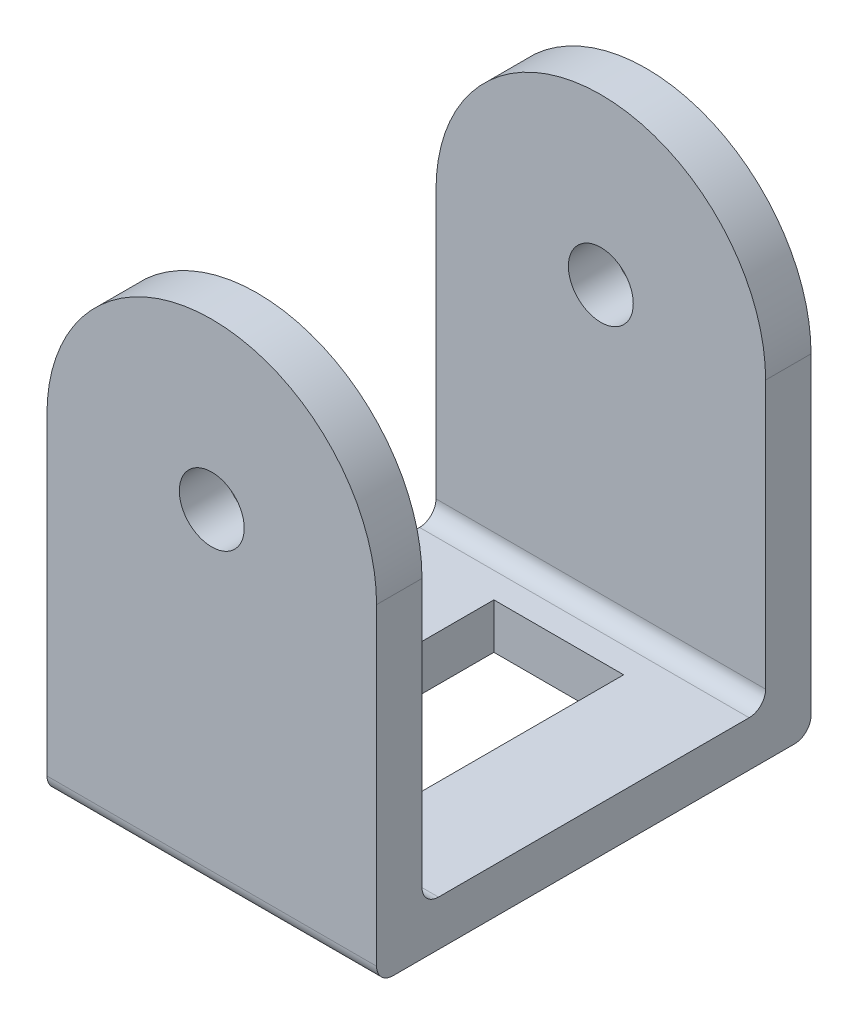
ISO-10303-21;
HEADER;
FILE_DESCRIPTION(('STEP AP214'),'2;1');
FILE_NAME('part.step','',(''),(''),'','','');
FILE_SCHEMA(('AUTOMOTIVE_DESIGN { 1 0 10303 214 1 1 1 1 }'));
ENDSEC;
DATA;
#1=APPLICATION_CONTEXT('core data for automotive mechanical design processes');
#2=APPLICATION_PROTOCOL_DEFINITION('international standard','automotive_design',2000,#1);
#3=PRODUCT_CONTEXT('',#1,'mechanical');
#4=PRODUCT('Part','Part','',(#3));
#5=PRODUCT_RELATED_PRODUCT_CATEGORY('part','',(#4));
#6=PRODUCT_DEFINITION_FORMATION('','',#4);
#7=PRODUCT_DEFINITION_CONTEXT('part definition',#1,'design');
#8=PRODUCT_DEFINITION('design','',#6,#7);
#9=PRODUCT_DEFINITION_SHAPE('','',#8);
#10=(LENGTH_UNIT() NAMED_UNIT(*) SI_UNIT(.MILLI.,.METRE.));
#11=(NAMED_UNIT(*) PLANE_ANGLE_UNIT() SI_UNIT($,.RADIAN.));
#12=(NAMED_UNIT(*) SI_UNIT($,.STERADIAN.) SOLID_ANGLE_UNIT());
#13=UNCERTAINTY_MEASURE_WITH_UNIT(LENGTH_MEASURE(1.E-05),#10,'distance_accuracy_value','');
#14=(GEOMETRIC_REPRESENTATION_CONTEXT(3) GLOBAL_UNCERTAINTY_ASSIGNED_CONTEXT((#13)) GLOBAL_UNIT_ASSIGNED_CONTEXT((#10,
#11,#12)) REPRESENTATION_CONTEXT('',''));
#15=CARTESIAN_POINT('',(0.,0.,0.));
#16=DIRECTION('',(0.,0.,1.));
#17=DIRECTION('',(1.,0.,0.));
#18=AXIS2_PLACEMENT_3D('',#15,#16,#17);
#19=CARTESIAN_POINT('',(0.,50.8,33.48));
#20=DIRECTION('',(0.,0.,1.));
#21=DIRECTION('',(1.,0.,0.));
#22=AXIS2_PLACEMENT_3D('',#19,#20,#21);
#23=CYLINDRICAL_SURFACE('',#22,25.4);
#24=DIRECTION('',(0.,0.,-1.));
#25=VECTOR('',#24,1.);
#26=CARTESIAN_POINT('',(-25.4,50.8,33.48));
#27=LINE('',#26,#25);
#28=CARTESIAN_POINT('',(-25.4,50.8,33.48));
#29=VERTEX_POINT('',#28);
#30=CARTESIAN_POINT('',(-25.4,50.8,26.48));
#31=VERTEX_POINT('',#30);
#32=EDGE_CURVE('E238',#29,#31,#27,.T.);
#33=ORIENTED_EDGE('',*,*,#32,.F.);
#34=CARTESIAN_POINT('',(0.,50.8,33.48));
#35=DIRECTION('',(0.,0.,-1.));
#36=DIRECTION('',(-1.,0.,0.));
#37=AXIS2_PLACEMENT_3D('',#34,#35,#36);
#38=CIRCLE('',#37,25.4);
#39=CARTESIAN_POINT('',(25.4,50.8,33.48));
#40=VERTEX_POINT('',#39);
#41=EDGE_CURVE('E244',#40,#29,#38,.F.);
#42=ORIENTED_EDGE('',*,*,#41,.F.);
#43=DIRECTION('',(0.,0.,-1.));
#44=VECTOR('',#43,1.);
#45=CARTESIAN_POINT('',(25.4,50.8,33.48));
#46=LINE('',#45,#44);
#47=CARTESIAN_POINT('',(25.4,50.8,26.48));
#48=VERTEX_POINT('',#47);
#49=EDGE_CURVE('E241',#48,#40,#46,.F.);
#50=ORIENTED_EDGE('',*,*,#49,.F.);
#51=CARTESIAN_POINT('',(0.,50.8,26.48));
#52=DIRECTION('',(0.,0.,1.));
#53=DIRECTION('',(1.,0.,0.));
#54=AXIS2_PLACEMENT_3D('',#51,#52,#53);
#55=CIRCLE('',#54,25.4);
#56=EDGE_CURVE('E246',#31,#48,#55,.F.);
#57=ORIENTED_EDGE('',*,*,#56,.F.);
#58=EDGE_LOOP('',(#33,#42,#50,#57));
#59=FACE_BOUND('',#58,.T.);
#60=ADVANCED_FACE('F45',(#59),#23,.T.);
#61=CARTESIAN_POINT('',(0.,50.8,-26.48));
#62=DIRECTION('',(0.,0.,1.));
#63=DIRECTION('',(1.,0.,0.));
#64=AXIS2_PLACEMENT_3D('',#61,#62,#63);
#65=CYLINDRICAL_SURFACE('',#64,25.4);
#66=DIRECTION('',(0.,0.,-1.));
#67=VECTOR('',#66,1.);
#68=CARTESIAN_POINT('',(-25.4,50.8,-26.48));
#69=LINE('',#68,#67);
#70=CARTESIAN_POINT('',(-25.4,50.8,-26.48));
#71=VERTEX_POINT('',#70);
#72=CARTESIAN_POINT('',(-25.4,50.8,-33.48));
#73=VERTEX_POINT('',#72);
#74=EDGE_CURVE('E228',#71,#73,#69,.T.);
#75=ORIENTED_EDGE('',*,*,#74,.F.);
#76=CARTESIAN_POINT('',(0.,50.8,-26.48));
#77=DIRECTION('',(0.,0.,-1.));
#78=DIRECTION('',(-1.,0.,0.));
#79=AXIS2_PLACEMENT_3D('',#76,#77,#78);
#80=CIRCLE('',#79,25.4);
#81=CARTESIAN_POINT('',(25.4,50.8,-26.48));
#82=VERTEX_POINT('',#81);
#83=EDGE_CURVE('E234',#82,#71,#80,.F.);
#84=ORIENTED_EDGE('',*,*,#83,.F.);
#85=DIRECTION('',(0.,0.,-1.));
#86=VECTOR('',#85,1.);
#87=CARTESIAN_POINT('',(25.4,50.8,-26.48));
#88=LINE('',#87,#86);
#89=CARTESIAN_POINT('',(25.4,50.8,-33.48));
#90=VERTEX_POINT('',#89);
#91=EDGE_CURVE('E231',#90,#82,#88,.F.);
#92=ORIENTED_EDGE('',*,*,#91,.F.);
#93=CARTESIAN_POINT('',(0.,50.8,-33.48));
#94=DIRECTION('',(0.,0.,1.));
#95=DIRECTION('',(1.,0.,0.));
#96=AXIS2_PLACEMENT_3D('',#93,#94,#95);
#97=CIRCLE('',#96,25.4);
#98=EDGE_CURVE('E236',#73,#90,#97,.F.);
#99=ORIENTED_EDGE('',*,*,#98,.F.);
#100=EDGE_LOOP('',(#75,#84,#92,#99));
#101=FACE_BOUND('',#100,.T.);
#102=ADVANCED_FACE('F362',(#101),#65,.T.);
#103=CARTESIAN_POINT('',(0.,7.,0.));
#104=DIRECTION('',(0.,1.,0.));
#105=DIRECTION('',(0.,0.,1.));
#106=AXIS2_PLACEMENT_3D('',#103,#104,#105);
#107=PLANE('',#106);
#108=DIRECTION('',(0.,0.,1.));
#109=VECTOR('',#108,1.);
#110=CARTESIAN_POINT('',(-10.,7.,20.));
#111=LINE('',#110,#109);
#112=CARTESIAN_POINT('',(-10.,7.,-20.));
#113=VERTEX_POINT('',#112);
#114=CARTESIAN_POINT('',(-10.,7.,20.));
#115=VERTEX_POINT('',#114);
#116=EDGE_CURVE('E165',#113,#115,#111,.T.);
#117=ORIENTED_EDGE('',*,*,#116,.F.);
#118=DIRECTION('',(-1.,0.,0.));
#119=VECTOR('',#118,1.);
#120=CARTESIAN_POINT('',(10.,7.,-20.));
#121=LINE('',#120,#119);
#122=CARTESIAN_POINT('',(10.,7.,-20.));
#123=VERTEX_POINT('',#122);
#124=EDGE_CURVE('E183',#123,#113,#121,.T.);
#125=ORIENTED_EDGE('',*,*,#124,.F.);
#126=DIRECTION('',(0.,0.,-1.));
#127=VECTOR('',#126,1.);
#128=CARTESIAN_POINT('',(10.,7.,20.));
#129=LINE('',#128,#127);
#130=CARTESIAN_POINT('',(10.,7.,20.));
#131=VERTEX_POINT('',#130);
#132=EDGE_CURVE('E186',#131,#123,#129,.T.);
#133=ORIENTED_EDGE('',*,*,#132,.F.);
#134=DIRECTION('',(1.,0.,0.));
#135=VECTOR('',#134,1.);
#136=CARTESIAN_POINT('',(10.,7.,20.));
#137=LINE('',#136,#135);
#138=EDGE_CURVE('E195',#115,#131,#137,.T.);
#139=ORIENTED_EDGE('',*,*,#138,.F.);
#140=EDGE_LOOP('',(#117,#125,#133,#139));
#141=FACE_BOUND('',#140,.T.);
#142=DIRECTION('',(0.,0.,1.));
#143=VECTOR('',#142,1.);
#144=CARTESIAN_POINT('',(-25.4,7.,33.48));
#145=LINE('',#144,#143);
#146=CARTESIAN_POINT('',(-25.4,7.,-23.94));
#147=VERTEX_POINT('',#146);
#148=CARTESIAN_POINT('',(-25.4,7.,23.94));
#149=VERTEX_POINT('',#148);
#150=EDGE_CURVE('E205',#147,#149,#145,.T.);
#151=ORIENTED_EDGE('',*,*,#150,.T.);
#152=DIRECTION('',(-1.,0.,0.));
#153=VECTOR('',#152,1.);
#154=CARTESIAN_POINT('',(0.,7.,23.94));
#155=LINE('',#154,#153);
#156=CARTESIAN_POINT('',(25.4,7.,23.94));
#157=VERTEX_POINT('',#156);
#158=EDGE_CURVE('E257',#149,#157,#155,.F.);
#159=ORIENTED_EDGE('',*,*,#158,.T.);
#160=DIRECTION('',(0.,0.,-1.));
#161=VECTOR('',#160,1.);
#162=CARTESIAN_POINT('',(25.4,7.,33.48));
#163=LINE('',#162,#161);
#164=CARTESIAN_POINT('',(25.4,7.,-23.94));
#165=VERTEX_POINT('',#164);
#166=EDGE_CURVE('E208',#157,#165,#163,.T.);
#167=ORIENTED_EDGE('',*,*,#166,.T.);
#168=DIRECTION('',(1.,0.,0.));
#169=VECTOR('',#168,1.);
#170=CARTESIAN_POINT('',(0.,7.,-23.94));
#171=LINE('',#170,#169);
#172=EDGE_CURVE('E255',#165,#147,#171,.F.);
#173=ORIENTED_EDGE('',*,*,#172,.T.);
#174=EDGE_LOOP('',(#151,#159,#167,#173));
#175=FACE_BOUND('',#174,.T.);
#176=ADVANCED_FACE('F288',(#141,#175),#107,.T.);
#177=CARTESIAN_POINT('',(-25.4,7.,33.48));
#178=DIRECTION('',(1.,0.,0.));
#179=DIRECTION('',(0.,0.,-1.));
#180=AXIS2_PLACEMENT_3D('',#177,#178,#179);
#181=PLANE('',#180);
#182=DIRECTION('',(0.,-1.,0.));
#183=VECTOR('',#182,1.);
#184=CARTESIAN_POINT('',(-25.4,7.,-33.48));
#185=LINE('',#184,#183);
#186=CARTESIAN_POINT('',(-25.4,2.54,-33.48));
#187=VERTEX_POINT('',#186);
#188=EDGE_CURVE('E212',#73,#187,#185,.T.);
#189=ORIENTED_EDGE('',*,*,#188,.T.);
#190=CARTESIAN_POINT('',(-25.4,2.54,-30.94));
#191=DIRECTION('',(1.,0.,0.));
#192=DIRECTION('',(0.,0.,-1.));
#193=AXIS2_PLACEMENT_3D('',#190,#191,#192);
#194=CIRCLE('',#193,2.54);
#195=CARTESIAN_POINT('',(-25.4,0.,-30.94));
#196=VERTEX_POINT('',#195);
#197=EDGE_CURVE('E264',#187,#196,#194,.F.);
#198=ORIENTED_EDGE('',*,*,#197,.T.);
#199=DIRECTION('',(0.,0.,1.));
#200=VECTOR('',#199,1.);
#201=CARTESIAN_POINT('',(-25.4,0.,33.48));
#202=LINE('',#201,#200);
#203=CARTESIAN_POINT('',(-25.4,0.,30.94));
#204=VERTEX_POINT('',#203);
#205=EDGE_CURVE('E201',#196,#204,#202,.T.);
#206=ORIENTED_EDGE('',*,*,#205,.T.);
#207=CARTESIAN_POINT('',(-25.4,2.54,30.94));
#208=DIRECTION('',(1.,0.,0.));
#209=DIRECTION('',(0.,0.,-1.));
#210=AXIS2_PLACEMENT_3D('',#207,#208,#209);
#211=CIRCLE('',#210,2.54);
#212=CARTESIAN_POINT('',(-25.4,2.54,33.48));
#213=VERTEX_POINT('',#212);
#214=EDGE_CURVE('E262',#204,#213,#211,.F.);
#215=ORIENTED_EDGE('',*,*,#214,.T.);
#216=DIRECTION('',(0.,-1.,0.));
#217=VECTOR('',#216,1.);
#218=CARTESIAN_POINT('',(-25.4,7.,33.48));
#219=LINE('',#218,#217);
#220=EDGE_CURVE('E225',#29,#213,#219,.T.);
#221=ORIENTED_EDGE('',*,*,#220,.F.);
#222=ORIENTED_EDGE('',*,*,#32,.T.);
#223=DIRECTION('',(0.,-1.,0.));
#224=VECTOR('',#223,1.);
#225=CARTESIAN_POINT('',(-25.4,76.2,26.48));
#226=LINE('',#225,#224);
#227=CARTESIAN_POINT('',(-25.4,9.54000000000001,26.48));
#228=VERTEX_POINT('',#227);
#229=EDGE_CURVE('E299',#31,#228,#226,.T.);
#230=ORIENTED_EDGE('',*,*,#229,.T.);
#231=CARTESIAN_POINT('',(-25.4,9.54000000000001,23.94));
#232=DIRECTION('',(1.,0.,0.));
#233=DIRECTION('',(0.,0.,-1.));
#234=AXIS2_PLACEMENT_3D('',#231,#232,#233);
#235=CIRCLE('',#234,2.54);
#236=EDGE_CURVE('E277',#228,#149,#235,.T.);
#237=ORIENTED_EDGE('',*,*,#236,.T.);
#238=ORIENTED_EDGE('',*,*,#150,.F.);
#239=CARTESIAN_POINT('',(-25.4,9.54000000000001,-23.94));
#240=DIRECTION('',(1.,0.,0.));
#241=DIRECTION('',(0.,0.,-1.));
#242=AXIS2_PLACEMENT_3D('',#239,#240,#241);
#243=CIRCLE('',#242,2.54);
#244=CARTESIAN_POINT('',(-25.4,9.54000000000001,-26.48));
#245=VERTEX_POINT('',#244);
#246=EDGE_CURVE('E11',#147,#245,#243,.T.);
#247=ORIENTED_EDGE('',*,*,#246,.T.);
#248=DIRECTION('',(0.,-1.,0.));
#249=VECTOR('',#248,1.);
#250=CARTESIAN_POINT('',(-25.4,76.2,-26.48));
#251=LINE('',#250,#249);
#252=EDGE_CURVE('E189',#71,#245,#251,.T.);
#253=ORIENTED_EDGE('',*,*,#252,.F.);
#254=ORIENTED_EDGE('',*,*,#74,.T.);
#255=EDGE_LOOP('',(#189,#198,#206,#215,#221,#222,#230,#237,#238,#247,#253,#254));
#256=FACE_BOUND('',#255,.T.);
#257=ADVANCED_FACE('F295',(#256),#181,.F.);
#258=CARTESIAN_POINT('',(25.4,7.,33.48));
#259=DIRECTION('',(0.,0.,-1.));
#260=DIRECTION('',(-1.,0.,0.));
#261=AXIS2_PLACEMENT_3D('',#258,#259,#260);
#262=PLANE('',#261);
#263=CARTESIAN_POINT('',(0.,50.8,33.48));
#264=DIRECTION('',(0.,0.,-1.));
#265=DIRECTION('',(-1.,0.,0.));
#266=AXIS2_PLACEMENT_3D('',#263,#264,#265);
#267=CIRCLE('',#266,5.);
#268=CARTESIAN_POINT('',(-5.,50.8,33.48));
#269=VERTEX_POINT('',#268);
#270=EDGE_CURVE('E306',#269,#269,#267,.T.);
#271=ORIENTED_EDGE('',*,*,#270,.T.);
#272=EDGE_LOOP('',(#271));
#273=FACE_BOUND('',#272,.T.);
#274=ORIENTED_EDGE('',*,*,#220,.T.);
#275=DIRECTION('',(1.,0.,0.));
#276=VECTOR('',#275,1.);
#277=CARTESIAN_POINT('',(25.4,2.54,33.48));
#278=LINE('',#277,#276);
#279=CARTESIAN_POINT('',(25.4,2.54,33.48));
#280=VERTEX_POINT('',#279);
#281=EDGE_CURVE('E273',#213,#280,#278,.T.);
#282=ORIENTED_EDGE('',*,*,#281,.T.);
#283=DIRECTION('',(0.,-1.,0.));
#284=VECTOR('',#283,1.);
#285=CARTESIAN_POINT('',(25.4,7.,33.48));
#286=LINE('',#285,#284);
#287=EDGE_CURVE('E222',#40,#280,#286,.T.);
#288=ORIENTED_EDGE('',*,*,#287,.F.);
#289=ORIENTED_EDGE('',*,*,#41,.T.);
#290=EDGE_LOOP('',(#274,#282,#288,#289));
#291=FACE_BOUND('',#290,.T.);
#292=ADVANCED_FACE('F342',(#273,#291),#262,.F.);
#293=CARTESIAN_POINT('',(25.4,7.,33.48));
#294=DIRECTION('',(-1.,0.,0.));
#295=DIRECTION('',(0.,0.,1.));
#296=AXIS2_PLACEMENT_3D('',#293,#294,#295);
#297=PLANE('',#296);
#298=DIRECTION('',(0.,0.,-1.));
#299=VECTOR('',#298,1.);
#300=CARTESIAN_POINT('',(25.4,0.,33.48));
#301=LINE('',#300,#299);
#302=CARTESIAN_POINT('',(25.4,0.,30.94));
#303=VERTEX_POINT('',#302);
#304=CARTESIAN_POINT('',(25.4,0.,-30.94));
#305=VERTEX_POINT('',#304);
#306=EDGE_CURVE('E209',#303,#305,#301,.T.);
#307=ORIENTED_EDGE('',*,*,#306,.T.);
#308=CARTESIAN_POINT('',(25.4,2.54,-30.94));
#309=DIRECTION('',(-1.,0.,0.));
#310=DIRECTION('',(0.,0.,1.));
#311=AXIS2_PLACEMENT_3D('',#308,#309,#310);
#312=CIRCLE('',#311,2.54);
#313=CARTESIAN_POINT('',(25.4,2.54,-33.48));
#314=VERTEX_POINT('',#313);
#315=EDGE_CURVE('E271',#305,#314,#312,.F.);
#316=ORIENTED_EDGE('',*,*,#315,.T.);
#317=DIRECTION('',(0.,-1.,0.));
#318=VECTOR('',#317,1.);
#319=CARTESIAN_POINT('',(25.4,7.,-33.48));
#320=LINE('',#319,#318);
#321=EDGE_CURVE('E219',#90,#314,#320,.T.);
#322=ORIENTED_EDGE('',*,*,#321,.F.);
#323=ORIENTED_EDGE('',*,*,#91,.T.);
#324=DIRECTION('',(0.,-1.,0.));
#325=VECTOR('',#324,1.);
#326=CARTESIAN_POINT('',(25.4,76.2,-26.48));
#327=LINE('',#326,#325);
#328=CARTESIAN_POINT('',(25.4,9.54000000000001,-26.48));
#329=VERTEX_POINT('',#328);
#330=EDGE_CURVE('E286',#82,#329,#327,.T.);
#331=ORIENTED_EDGE('',*,*,#330,.T.);
#332=CARTESIAN_POINT('',(25.4,9.54000000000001,-23.94));
#333=DIRECTION('',(-1.,0.,0.));
#334=DIRECTION('',(0.,0.,1.));
#335=AXIS2_PLACEMENT_3D('',#332,#333,#334);
#336=CIRCLE('',#335,2.54);
#337=EDGE_CURVE('E53',#329,#165,#336,.T.);
#338=ORIENTED_EDGE('',*,*,#337,.T.);
#339=ORIENTED_EDGE('',*,*,#166,.F.);
#340=CARTESIAN_POINT('',(25.4,9.54000000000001,23.94));
#341=DIRECTION('',(-1.,0.,0.));
#342=DIRECTION('',(0.,0.,1.));
#343=AXIS2_PLACEMENT_3D('',#340,#341,#342);
#344=CIRCLE('',#343,2.54);
#345=CARTESIAN_POINT('',(25.4,9.54000000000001,26.48));
#346=VERTEX_POINT('',#345);
#347=EDGE_CURVE('E279',#157,#346,#344,.T.);
#348=ORIENTED_EDGE('',*,*,#347,.T.);
#349=DIRECTION('',(0.,-1.,0.));
#350=VECTOR('',#349,1.);
#351=CARTESIAN_POINT('',(25.4,76.2,26.48));
#352=LINE('',#351,#350);
#353=EDGE_CURVE('E301',#48,#346,#352,.T.);
#354=ORIENTED_EDGE('',*,*,#353,.F.);
#355=ORIENTED_EDGE('',*,*,#49,.T.);
#356=ORIENTED_EDGE('',*,*,#287,.T.);
#357=CARTESIAN_POINT('',(25.4,2.54,30.94));
#358=DIRECTION('',(-1.,0.,0.));
#359=DIRECTION('',(0.,0.,1.));
#360=AXIS2_PLACEMENT_3D('',#357,#358,#359);
#361=CIRCLE('',#360,2.54);
#362=EDGE_CURVE('E67',#280,#303,#361,.F.);
#363=ORIENTED_EDGE('',*,*,#362,.T.);
#364=EDGE_LOOP('',(#307,#316,#322,#323,#331,#338,#339,#348,#354,#355,#356,#363));
#365=FACE_BOUND('',#364,.T.);
#366=ADVANCED_FACE('F283',(#365),#297,.F.);
#367=CARTESIAN_POINT('',(25.4,7.,-33.48));
#368=DIRECTION('',(0.,0.,1.));
#369=DIRECTION('',(1.,0.,0.));
#370=AXIS2_PLACEMENT_3D('',#367,#368,#369);
#371=PLANE('',#370);
#372=CARTESIAN_POINT('',(0.,50.8,-33.48));
#373=DIRECTION('',(0.,0.,1.));
#374=DIRECTION('',(1.,0.,0.));
#375=AXIS2_PLACEMENT_3D('',#372,#373,#374);
#376=CIRCLE('',#375,5.);
#377=CARTESIAN_POINT('',(5.,50.8,-33.48));
#378=VERTEX_POINT('',#377);
#379=EDGE_CURVE('E309',#378,#378,#376,.T.);
#380=ORIENTED_EDGE('',*,*,#379,.T.);
#381=EDGE_LOOP('',(#380));
#382=FACE_BOUND('',#381,.T.);
#383=ORIENTED_EDGE('',*,*,#321,.T.);
#384=DIRECTION('',(-1.,0.,0.));
#385=VECTOR('',#384,1.);
#386=CARTESIAN_POINT('',(25.4,2.54,-33.48));
#387=LINE('',#386,#385);
#388=EDGE_CURVE('E259',#314,#187,#387,.T.);
#389=ORIENTED_EDGE('',*,*,#388,.T.);
#390=ORIENTED_EDGE('',*,*,#188,.F.);
#391=ORIENTED_EDGE('',*,*,#98,.T.);
#392=EDGE_LOOP('',(#383,#389,#390,#391));
#393=FACE_BOUND('',#392,.T.);
#394=ADVANCED_FACE('F324',(#382,#393),#371,.F.);
#395=CARTESIAN_POINT('',(0.,0.,0.));
#396=DIRECTION('',(0.,1.,0.));
#397=DIRECTION('',(0.,0.,1.));
#398=AXIS2_PLACEMENT_3D('',#395,#396,#397);
#399=PLANE('',#398);
#400=DIRECTION('',(-1.,0.,0.));
#401=VECTOR('',#400,1.);
#402=CARTESIAN_POINT('',(10.,0.,-20.));
#403=LINE('',#402,#401);
#404=CARTESIAN_POINT('',(10.,0.,-20.));
#405=VERTEX_POINT('',#404);
#406=CARTESIAN_POINT('',(-10.,0.,-20.));
#407=VERTEX_POINT('',#406);
#408=EDGE_CURVE('E170',#405,#407,#403,.T.);
#409=ORIENTED_EDGE('',*,*,#408,.T.);
#410=DIRECTION('',(0.,0.,1.));
#411=VECTOR('',#410,1.);
#412=CARTESIAN_POINT('',(-10.,0.,20.));
#413=LINE('',#412,#411);
#414=CARTESIAN_POINT('',(-10.,0.,20.));
#415=VERTEX_POINT('',#414);
#416=EDGE_CURVE('E162',#407,#415,#413,.T.);
#417=ORIENTED_EDGE('',*,*,#416,.T.);
#418=DIRECTION('',(1.,0.,0.));
#419=VECTOR('',#418,1.);
#420=CARTESIAN_POINT('',(10.,0.,20.));
#421=LINE('',#420,#419);
#422=CARTESIAN_POINT('',(10.,0.,20.));
#423=VERTEX_POINT('',#422);
#424=EDGE_CURVE('E174',#415,#423,#421,.T.);
#425=ORIENTED_EDGE('',*,*,#424,.T.);
#426=DIRECTION('',(0.,0.,-1.));
#427=VECTOR('',#426,1.);
#428=CARTESIAN_POINT('',(10.,0.,20.));
#429=LINE('',#428,#427);
#430=EDGE_CURVE('E178',#423,#405,#429,.T.);
#431=ORIENTED_EDGE('',*,*,#430,.T.);
#432=EDGE_LOOP('',(#409,#417,#425,#431));
#433=FACE_BOUND('',#432,.T.);
#434=ORIENTED_EDGE('',*,*,#205,.F.);
#435=DIRECTION('',(-1.,0.,0.));
#436=VECTOR('',#435,1.);
#437=CARTESIAN_POINT('',(0.,0.,-30.94));
#438=LINE('',#437,#436);
#439=EDGE_CURVE('E268',#196,#305,#438,.F.);
#440=ORIENTED_EDGE('',*,*,#439,.T.);
#441=ORIENTED_EDGE('',*,*,#306,.F.);
#442=DIRECTION('',(1.,0.,0.));
#443=VECTOR('',#442,1.);
#444=CARTESIAN_POINT('',(0.,0.,30.94));
#445=LINE('',#444,#443);
#446=EDGE_CURVE('E266',#303,#204,#445,.F.);
#447=ORIENTED_EDGE('',*,*,#446,.T.);
#448=EDGE_LOOP('',(#434,#440,#441,#447));
#449=FACE_BOUND('',#448,.T.);
#450=ADVANCED_FACE('F180',(#433,#449),#399,.F.);
#451=CARTESIAN_POINT('',(-10.,0.,20.));
#452=DIRECTION('',(-1.,0.,0.));
#453=DIRECTION('',(0.,0.,1.));
#454=AXIS2_PLACEMENT_3D('',#451,#452,#453);
#455=PLANE('',#454);
#456=ORIENTED_EDGE('',*,*,#116,.T.);
#457=DIRECTION('',(0.,1.,0.));
#458=VECTOR('',#457,1.);
#459=CARTESIAN_POINT('',(-10.,0.,20.));
#460=LINE('',#459,#458);
#461=EDGE_CURVE('E158',#415,#115,#460,.T.);
#462=ORIENTED_EDGE('',*,*,#461,.F.);
#463=ORIENTED_EDGE('',*,*,#416,.F.);
#464=DIRECTION('',(0.,1.,0.));
#465=VECTOR('',#464,1.);
#466=CARTESIAN_POINT('',(-10.,0.,-20.));
#467=LINE('',#466,#465);
#468=EDGE_CURVE('E199',#407,#113,#467,.T.);
#469=ORIENTED_EDGE('',*,*,#468,.T.);
#470=EDGE_LOOP('',(#456,#462,#463,#469));
#471=FACE_BOUND('',#470,.T.);
#472=ADVANCED_FACE('F160',(#471),#455,.F.);
#473=CARTESIAN_POINT('',(10.,0.,-20.));
#474=DIRECTION('',(0.,0.,-1.));
#475=DIRECTION('',(-1.,0.,0.));
#476=AXIS2_PLACEMENT_3D('',#473,#474,#475);
#477=PLANE('',#476);
#478=ORIENTED_EDGE('',*,*,#124,.T.);
#479=ORIENTED_EDGE('',*,*,#468,.F.);
#480=ORIENTED_EDGE('',*,*,#408,.F.);
#481=DIRECTION('',(0.,1.,0.));
#482=VECTOR('',#481,1.);
#483=CARTESIAN_POINT('',(10.,0.,-20.));
#484=LINE('',#483,#482);
#485=EDGE_CURVE('E202',#405,#123,#484,.T.);
#486=ORIENTED_EDGE('',*,*,#485,.T.);
#487=EDGE_LOOP('',(#478,#479,#480,#486));
#488=FACE_BOUND('',#487,.T.);
#489=ADVANCED_FACE('F390',(#488),#477,.F.);
#490=CARTESIAN_POINT('',(10.,0.,20.));
#491=DIRECTION('',(1.,0.,0.));
#492=DIRECTION('',(0.,0.,-1.));
#493=AXIS2_PLACEMENT_3D('',#490,#491,#492);
#494=PLANE('',#493);
#495=ORIENTED_EDGE('',*,*,#132,.T.);
#496=ORIENTED_EDGE('',*,*,#485,.F.);
#497=ORIENTED_EDGE('',*,*,#430,.F.);
#498=DIRECTION('',(0.,1.,0.));
#499=VECTOR('',#498,1.);
#500=CARTESIAN_POINT('',(10.,0.,20.));
#501=LINE('',#500,#499);
#502=EDGE_CURVE('E169',#423,#131,#501,.T.);
#503=ORIENTED_EDGE('',*,*,#502,.T.);
#504=EDGE_LOOP('',(#495,#496,#497,#503));
#505=FACE_BOUND('',#504,.T.);
#506=ADVANCED_FACE('F393',(#505),#494,.F.);
#507=CARTESIAN_POINT('',(10.,0.,20.));
#508=DIRECTION('',(0.,0.,1.));
#509=DIRECTION('',(1.,0.,0.));
#510=AXIS2_PLACEMENT_3D('',#507,#508,#509);
#511=PLANE('',#510);
#512=ORIENTED_EDGE('',*,*,#138,.T.);
#513=ORIENTED_EDGE('',*,*,#502,.F.);
#514=ORIENTED_EDGE('',*,*,#424,.F.);
#515=ORIENTED_EDGE('',*,*,#461,.T.);
#516=EDGE_LOOP('',(#512,#513,#514,#515));
#517=FACE_BOUND('',#516,.T.);
#518=ADVANCED_FACE('F175',(#517),#511,.F.);
#519=CARTESIAN_POINT('',(-25.4,76.2,-26.48));
#520=DIRECTION('',(0.,0.,-1.));
#521=DIRECTION('',(-1.,0.,0.));
#522=AXIS2_PLACEMENT_3D('',#519,#520,#521);
#523=PLANE('',#522);
#524=CARTESIAN_POINT('',(0.,50.8,-26.48));
#525=DIRECTION('',(0.,0.,-1.));
#526=DIRECTION('',(-1.,0.,0.));
#527=AXIS2_PLACEMENT_3D('',#524,#525,#526);
#528=CIRCLE('',#527,5.);
#529=CARTESIAN_POINT('',(-5.,50.8,-26.48));
#530=VERTEX_POINT('',#529);
#531=EDGE_CURVE('E252',#530,#530,#528,.T.);
#532=ORIENTED_EDGE('',*,*,#531,.T.);
#533=EDGE_LOOP('',(#532));
#534=FACE_BOUND('',#533,.T.);
#535=ORIENTED_EDGE('',*,*,#252,.T.);
#536=DIRECTION('',(1.,0.,0.));
#537=VECTOR('',#536,1.);
#538=CARTESIAN_POINT('',(-25.4,9.54000000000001,-26.48));
#539=LINE('',#538,#537);
#540=EDGE_CURVE('E275',#245,#329,#539,.T.);
#541=ORIENTED_EDGE('',*,*,#540,.T.);
#542=ORIENTED_EDGE('',*,*,#330,.F.);
#543=ORIENTED_EDGE('',*,*,#83,.T.);
#544=EDGE_LOOP('',(#535,#541,#542,#543));
#545=FACE_BOUND('',#544,.T.);
#546=ADVANCED_FACE('F297',(#534,#545),#523,.F.);
#547=CARTESIAN_POINT('',(25.4,76.2,26.48));
#548=DIRECTION('',(0.,0.,1.));
#549=DIRECTION('',(1.,0.,0.));
#550=AXIS2_PLACEMENT_3D('',#547,#548,#549);
#551=PLANE('',#550);
#552=CARTESIAN_POINT('',(0.,50.8,26.48));
#553=DIRECTION('',(0.,0.,1.));
#554=DIRECTION('',(1.,0.,0.));
#555=AXIS2_PLACEMENT_3D('',#552,#553,#554);
#556=CIRCLE('',#555,5.);
#557=CARTESIAN_POINT('',(5.,50.8,26.48));
#558=VERTEX_POINT('',#557);
#559=EDGE_CURVE('E249',#558,#558,#556,.T.);
#560=ORIENTED_EDGE('',*,*,#559,.T.);
#561=EDGE_LOOP('',(#560));
#562=FACE_BOUND('',#561,.T.);
#563=ORIENTED_EDGE('',*,*,#353,.T.);
#564=DIRECTION('',(-1.,0.,0.));
#565=VECTOR('',#564,1.);
#566=CARTESIAN_POINT('',(25.4,9.54000000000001,26.48));
#567=LINE('',#566,#565);
#568=EDGE_CURVE('E248',#346,#228,#567,.T.);
#569=ORIENTED_EDGE('',*,*,#568,.T.);
#570=ORIENTED_EDGE('',*,*,#229,.F.);
#571=ORIENTED_EDGE('',*,*,#56,.T.);
#572=EDGE_LOOP('',(#563,#569,#570,#571));
#573=FACE_BOUND('',#572,.T.);
#574=ADVANCED_FACE('F349',(#562,#573),#551,.F.);
#575=CARTESIAN_POINT('',(0.,50.8,-426.48));
#576=DIRECTION('',(0.,0.,1.));
#577=DIRECTION('',(1.,0.,0.));
#578=AXIS2_PLACEMENT_3D('',#575,#576,#577);
#579=CYLINDRICAL_SURFACE('',#578,5.);
#580=ORIENTED_EDGE('',*,*,#559,.F.);
#581=EDGE_LOOP('',(#580));
#582=FACE_BOUND('',#581,.T.);
#583=ORIENTED_EDGE('',*,*,#270,.F.);
#584=EDGE_LOOP('',(#583));
#585=FACE_BOUND('',#584,.T.);
#586=ADVANCED_FACE('F320',(#582,#585),#579,.F.);
#587=ORIENTED_EDGE('',*,*,#531,.F.);
#588=EDGE_LOOP('',(#587));
#589=FACE_BOUND('',#588,.T.);
#590=ORIENTED_EDGE('',*,*,#379,.F.);
#591=EDGE_LOOP('',(#590));
#592=FACE_BOUND('',#591,.T.);
#593=ADVANCED_FACE('F316',(#589,#592),#579,.F.);
#594=CARTESIAN_POINT('',(25.4,9.54000000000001,23.94));
#595=DIRECTION('',(-1.,0.,0.));
#596=DIRECTION('',(0.,0.,1.));
#597=AXIS2_PLACEMENT_3D('',#594,#595,#596);
#598=CYLINDRICAL_SURFACE('',#597,2.54);
#599=ORIENTED_EDGE('',*,*,#347,.F.);
#600=ORIENTED_EDGE('',*,*,#158,.F.);
#601=ORIENTED_EDGE('',*,*,#236,.F.);
#602=ORIENTED_EDGE('',*,*,#568,.F.);
#603=EDGE_LOOP('',(#599,#600,#601,#602));
#604=FACE_BOUND('',#603,.T.);
#605=ADVANCED_FACE('F319',(#604),#598,.F.);
#606=CARTESIAN_POINT('',(25.4,2.54,-30.94));
#607=DIRECTION('',(-1.,0.,0.));
#608=DIRECTION('',(0.,0.,1.));
#609=AXIS2_PLACEMENT_3D('',#606,#607,#608);
#610=CYLINDRICAL_SURFACE('',#609,2.54);
#611=ORIENTED_EDGE('',*,*,#315,.F.);
#612=ORIENTED_EDGE('',*,*,#439,.F.);
#613=ORIENTED_EDGE('',*,*,#197,.F.);
#614=ORIENTED_EDGE('',*,*,#388,.F.);
#615=EDGE_LOOP('',(#611,#612,#613,#614));
#616=FACE_BOUND('',#615,.T.);
#617=ADVANCED_FACE('F334',(#616),#610,.T.);
#618=CARTESIAN_POINT('',(25.4,2.54,30.94));
#619=DIRECTION('',(1.,0.,0.));
#620=DIRECTION('',(0.,0.,-1.));
#621=AXIS2_PLACEMENT_3D('',#618,#619,#620);
#622=CYLINDRICAL_SURFACE('',#621,2.54);
#623=ORIENTED_EDGE('',*,*,#214,.F.);
#624=ORIENTED_EDGE('',*,*,#446,.F.);
#625=ORIENTED_EDGE('',*,*,#362,.F.);
#626=ORIENTED_EDGE('',*,*,#281,.F.);
#627=EDGE_LOOP('',(#623,#624,#625,#626));
#628=FACE_BOUND('',#627,.T.);
#629=ADVANCED_FACE('F339',(#628),#622,.T.);
#630=CARTESIAN_POINT('',(-25.4,9.54000000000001,-23.94));
#631=DIRECTION('',(1.,0.,0.));
#632=DIRECTION('',(0.,0.,-1.));
#633=AXIS2_PLACEMENT_3D('',#630,#631,#632);
#634=CYLINDRICAL_SURFACE('',#633,2.54);
#635=ORIENTED_EDGE('',*,*,#246,.F.);
#636=ORIENTED_EDGE('',*,*,#172,.F.);
#637=ORIENTED_EDGE('',*,*,#337,.F.);
#638=ORIENTED_EDGE('',*,*,#540,.F.);
#639=EDGE_LOOP('',(#635,#636,#637,#638));
#640=FACE_BOUND('',#639,.T.);
#641=ADVANCED_FACE('F47',(#640),#634,.F.);
#642=CLOSED_SHELL('',(#60,#102,#176,#257,#292,#366,#394,#450,#472,#489,#506,#518,#546,#574,#586,
#593,#605,#617,#629,#641));
#643=MANIFOLD_SOLID_BREP('B2',#642);
#644=ADVANCED_BREP_SHAPE_REPRESENTATION('',(#18,#643),#14);
#645=SHAPE_DEFINITION_REPRESENTATION(#9,#644);
ENDSEC;
END-ISO-10303-21;
